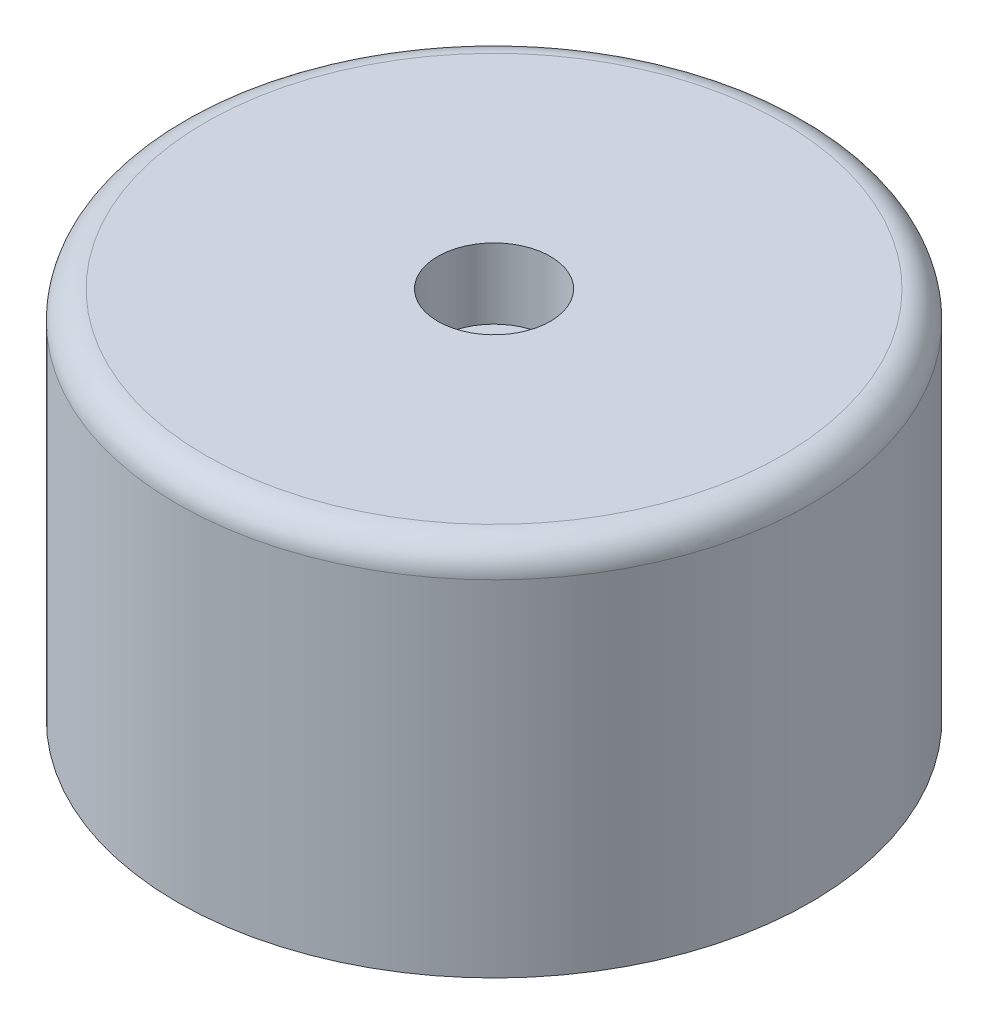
ISO-10303-21;
HEADER;
FILE_DESCRIPTION(('STEP AP214'),'2;1');
FILE_NAME('part.step','',(''),(''),'','','');
FILE_SCHEMA(('AUTOMOTIVE_DESIGN { 1 0 10303 214 1 1 1 1 }'));
ENDSEC;
DATA;
#1=APPLICATION_CONTEXT('core data for automotive mechanical design processes');
#2=APPLICATION_PROTOCOL_DEFINITION('international standard','automotive_design',2000,#1);
#3=PRODUCT_CONTEXT('',#1,'mechanical');
#4=PRODUCT('Part','Part','',(#3));
#5=PRODUCT_RELATED_PRODUCT_CATEGORY('part','',(#4));
#6=PRODUCT_DEFINITION_FORMATION('','',#4);
#7=PRODUCT_DEFINITION_CONTEXT('part definition',#1,'design');
#8=PRODUCT_DEFINITION('design','',#6,#7);
#9=PRODUCT_DEFINITION_SHAPE('','',#8);
#10=(LENGTH_UNIT() NAMED_UNIT(*) SI_UNIT(.MILLI.,.METRE.));
#11=(NAMED_UNIT(*) PLANE_ANGLE_UNIT() SI_UNIT($,.RADIAN.));
#12=(NAMED_UNIT(*) SI_UNIT($,.STERADIAN.) SOLID_ANGLE_UNIT());
#13=UNCERTAINTY_MEASURE_WITH_UNIT(LENGTH_MEASURE(1.E-05),#10,'distance_accuracy_value','');
#14=(GEOMETRIC_REPRESENTATION_CONTEXT(3) GLOBAL_UNCERTAINTY_ASSIGNED_CONTEXT((#13)) GLOBAL_UNIT_ASSIGNED_CONTEXT((#10,
#11,#12)) REPRESENTATION_CONTEXT('',''));
#15=CARTESIAN_POINT('',(0.,0.,0.));
#16=DIRECTION('',(0.,0.,1.));
#17=DIRECTION('',(1.,0.,0.));
#18=AXIS2_PLACEMENT_3D('',#15,#16,#17);
#19=CARTESIAN_POINT('',(0.,5.3,0.));
#20=DIRECTION('',(0.,-1.,0.));
#21=DIRECTION('',(0.,0.,-1.));
#22=AXIS2_PLACEMENT_3D('',#19,#20,#21);
#23=CYLINDRICAL_SURFACE('',#22,4.5);
#24=CARTESIAN_POINT('',(0.,4.9,0.));
#25=DIRECTION('',(0.,1.,0.));
#26=DIRECTION('',(0.,0.,1.));
#27=AXIS2_PLACEMENT_3D('',#24,#25,#26);
#28=CIRCLE('',#27,4.5);
#29=CARTESIAN_POINT('',(0.,4.9,4.5));
#30=VERTEX_POINT('',#29);
#31=EDGE_CURVE('E10',#30,#30,#28,.F.);
#32=ORIENTED_EDGE('',*,*,#31,.T.);
#33=EDGE_LOOP('',(#32));
#34=FACE_BOUND('',#33,.T.);
#35=CARTESIAN_POINT('',(0.,0.,0.));
#36=DIRECTION('',(0.,1.,0.));
#37=DIRECTION('',(0.,0.,1.));
#38=AXIS2_PLACEMENT_3D('',#35,#36,#37);
#39=CIRCLE('',#38,4.5);
#40=CARTESIAN_POINT('',(0.,0.,4.5));
#41=VERTEX_POINT('',#40);
#42=EDGE_CURVE('E34',#41,#41,#39,.T.);
#43=ORIENTED_EDGE('',*,*,#42,.T.);
#44=EDGE_LOOP('',(#43));
#45=FACE_BOUND('',#44,.T.);
#46=ADVANCED_FACE('F24',(#34,#45),#23,.T.);
#47=CARTESIAN_POINT('',(0.,5.3,0.));
#48=DIRECTION('',(0.,1.,0.));
#49=DIRECTION('',(0.,0.,1.));
#50=AXIS2_PLACEMENT_3D('',#47,#48,#49);
#51=PLANE('',#50);
#52=CARTESIAN_POINT('',(0.,5.3,0.));
#53=DIRECTION('',(0.,1.,0.));
#54=DIRECTION('',(0.,0.,1.));
#55=AXIS2_PLACEMENT_3D('',#52,#53,#54);
#56=CIRCLE('',#55,0.8);
#57=CARTESIAN_POINT('',(0.,5.3,0.8));
#58=VERTEX_POINT('',#57);
#59=EDGE_CURVE('E43',#58,#58,#56,.T.);
#60=ORIENTED_EDGE('',*,*,#59,.F.);
#61=EDGE_LOOP('',(#60));
#62=FACE_BOUND('',#61,.T.);
#63=CARTESIAN_POINT('',(0.,5.3,0.));
#64=DIRECTION('',(0.,1.,0.));
#65=DIRECTION('',(0.,0.,1.));
#66=AXIS2_PLACEMENT_3D('',#63,#64,#65);
#67=CIRCLE('',#66,4.1);
#68=CARTESIAN_POINT('',(0.,5.3,4.1));
#69=VERTEX_POINT('',#68);
#70=EDGE_CURVE('E30',#69,#69,#67,.T.);
#71=ORIENTED_EDGE('',*,*,#70,.T.);
#72=EDGE_LOOP('',(#71));
#73=FACE_BOUND('',#72,.T.);
#74=ADVANCED_FACE('F49',(#62,#73),#51,.T.);
#75=CARTESIAN_POINT('',(0.,0.,0.));
#76=DIRECTION('',(0.,1.,0.));
#77=DIRECTION('',(0.,0.,1.));
#78=AXIS2_PLACEMENT_3D('',#75,#76,#77);
#79=PLANE('',#78);
#80=ORIENTED_EDGE('',*,*,#42,.F.);
#81=EDGE_LOOP('',(#80));
#82=FACE_BOUND('',#81,.T.);
#83=ADVANCED_FACE('F51',(#82),#79,.F.);
#84=CARTESIAN_POINT('',(0.,4.9,0.));
#85=DIRECTION('',(0.,1.,0.));
#86=DIRECTION('',(0.,0.,1.));
#87=AXIS2_PLACEMENT_3D('',#84,#85,#86);
#88=TOROIDAL_SURFACE('',#87,4.1,0.4);
#89=ORIENTED_EDGE('',*,*,#31,.F.);
#90=EDGE_LOOP('',(#89));
#91=FACE_BOUND('',#90,.T.);
#92=ORIENTED_EDGE('',*,*,#70,.F.);
#93=EDGE_LOOP('',(#92));
#94=FACE_BOUND('',#93,.T.);
#95=ADVANCED_FACE('F57',(#91,#94),#88,.T.);
#96=CARTESIAN_POINT('',(0.,4.3,0.));
#97=DIRECTION('',(0.,1.,0.));
#98=DIRECTION('',(0.,0.,1.));
#99=AXIS2_PLACEMENT_3D('',#96,#97,#98);
#100=CYLINDRICAL_SURFACE('',#99,0.8);
#101=CARTESIAN_POINT('',(0.,4.3,0.));
#102=DIRECTION('',(0.,1.,0.));
#103=DIRECTION('',(0.,0.,1.));
#104=AXIS2_PLACEMENT_3D('',#101,#102,#103);
#105=CIRCLE('',#104,0.8);
#106=CARTESIAN_POINT('',(0.,4.3,0.8));
#107=VERTEX_POINT('',#106);
#108=EDGE_CURVE('E38',#107,#107,#105,.T.);
#109=ORIENTED_EDGE('',*,*,#108,.F.);
#110=EDGE_LOOP('',(#109));
#111=FACE_BOUND('',#110,.T.);
#112=ORIENTED_EDGE('',*,*,#59,.T.);
#113=EDGE_LOOP('',(#112));
#114=FACE_BOUND('',#113,.T.);
#115=ADVANCED_FACE('F47',(#111,#114),#100,.F.);
#116=CARTESIAN_POINT('',(0.,4.3,0.));
#117=DIRECTION('',(0.,1.,0.));
#118=DIRECTION('',(0.,0.,1.));
#119=AXIS2_PLACEMENT_3D('',#116,#117,#118);
#120=PLANE('',#119);
#121=ORIENTED_EDGE('',*,*,#108,.T.);
#122=EDGE_LOOP('',(#121));
#123=FACE_BOUND('',#122,.T.);
#124=ADVANCED_FACE('F65',(#123),#120,.T.);
#125=CLOSED_SHELL('',(#46,#74,#83,#95,#115,#124));
#126=MANIFOLD_SOLID_BREP('B2',#125);
#127=ADVANCED_BREP_SHAPE_REPRESENTATION('',(#18,#126),#14);
#128=SHAPE_DEFINITION_REPRESENTATION(#9,#127);
ENDSEC;
END-ISO-10303-21;
